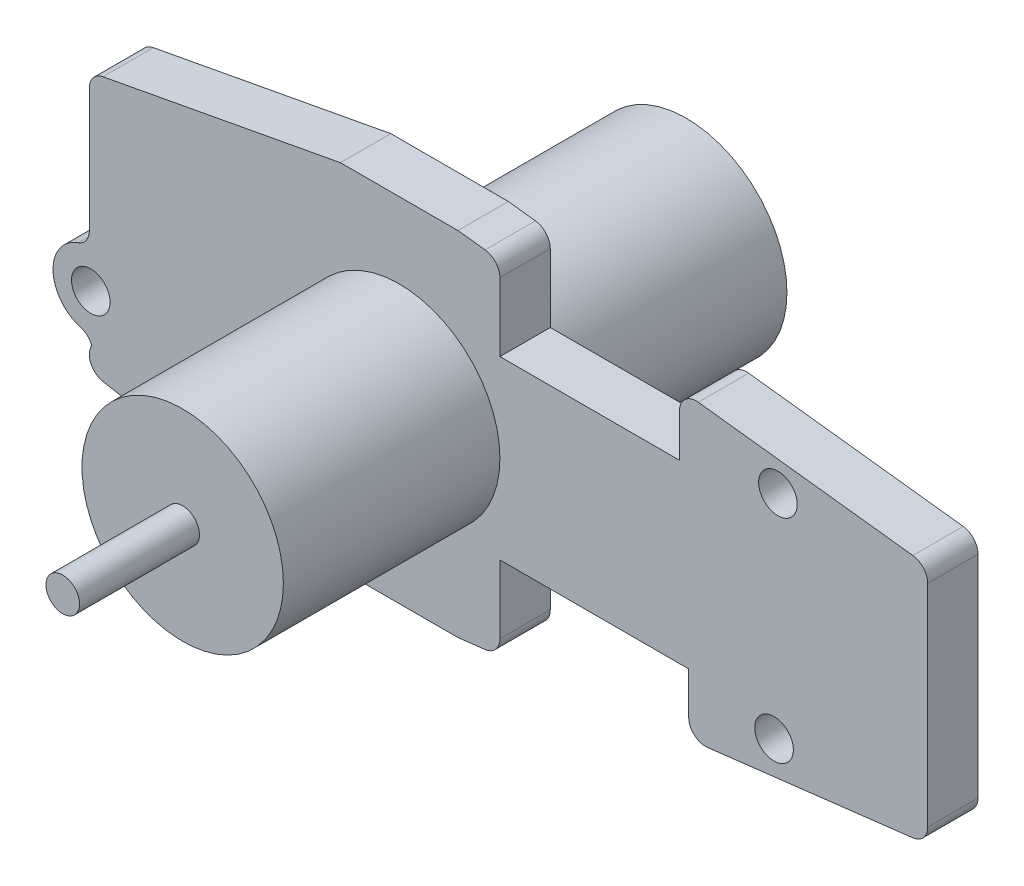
ISO-10303-21;
HEADER;
FILE_DESCRIPTION(('STEP AP214'),'2;1');
FILE_NAME('part.step','',(''),(''),'','','');
FILE_SCHEMA(('AUTOMOTIVE_DESIGN { 1 0 10303 214 1 1 1 1 }'));
ENDSEC;
DATA;
#1=APPLICATION_CONTEXT('core data for automotive mechanical design processes');
#2=APPLICATION_PROTOCOL_DEFINITION('international standard','automotive_design',2000,#1);
#3=PRODUCT_CONTEXT('',#1,'mechanical');
#4=PRODUCT('Part','Part','',(#3));
#5=PRODUCT_RELATED_PRODUCT_CATEGORY('part','',(#4));
#6=PRODUCT_DEFINITION_FORMATION('','',#4);
#7=PRODUCT_DEFINITION_CONTEXT('part definition',#1,'design');
#8=PRODUCT_DEFINITION('design','',#6,#7);
#9=PRODUCT_DEFINITION_SHAPE('','',#8);
#10=(LENGTH_UNIT() NAMED_UNIT(*) SI_UNIT(.MILLI.,.METRE.));
#11=(NAMED_UNIT(*) PLANE_ANGLE_UNIT() SI_UNIT($,.RADIAN.));
#12=(NAMED_UNIT(*) SI_UNIT($,.STERADIAN.) SOLID_ANGLE_UNIT());
#13=UNCERTAINTY_MEASURE_WITH_UNIT(LENGTH_MEASURE(1.E-05),#10,'distance_accuracy_value','');
#14=(GEOMETRIC_REPRESENTATION_CONTEXT(3) GLOBAL_UNCERTAINTY_ASSIGNED_CONTEXT((#13)) GLOBAL_UNIT_ASSIGNED_CONTEXT((#10,
#11,#12)) REPRESENTATION_CONTEXT('',''));
#15=CARTESIAN_POINT('',(0.,0.,0.));
#16=DIRECTION('',(0.,0.,1.));
#17=DIRECTION('',(1.,0.,0.));
#18=AXIS2_PLACEMENT_3D('',#15,#16,#17);
#19=CARTESIAN_POINT('',(0.,0.,37.1439675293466));
#20=DIRECTION('',(0.,0.,-1.));
#21=DIRECTION('',(-1.,0.,0.));
#22=AXIS2_PLACEMENT_3D('',#19,#20,#21);
#23=PLANE('',#22);
#24=CARTESIAN_POINT('',(0.,0.,37.1439675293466));
#25=DIRECTION('',(0.,0.,1.));
#26=DIRECTION('',(1.,0.,0.));
#27=AXIS2_PLACEMENT_3D('',#24,#25,#26);
#28=CIRCLE('',#27,1.);
#29=CARTESIAN_POINT('',(1.,0.,37.1439675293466));
#30=VERTEX_POINT('',#29);
#31=EDGE_CURVE('E20',#30,#30,#28,.F.);
#32=ORIENTED_EDGE('',*,*,#31,.F.);
#33=EDGE_LOOP('',(#32));
#34=FACE_BOUND('',#33,.T.);
#35=ADVANCED_FACE('F17',(#34),#23,.F.);
#36=CARTESIAN_POINT('',(0.,0.,36.));
#37=DIRECTION('',(0.,0.,1.));
#38=DIRECTION('',(1.,0.,0.));
#39=AXIS2_PLACEMENT_3D('',#36,#37,#38);
#40=CYLINDRICAL_SURFACE('',#39,1.);
#41=CARTESIAN_POINT('',(0.,0.,30.));
#42=DIRECTION('',(0.,0.,1.));
#43=DIRECTION('',(1.,0.,0.));
#44=AXIS2_PLACEMENT_3D('',#41,#42,#43);
#45=CIRCLE('',#44,1.);
#46=CARTESIAN_POINT('',(1.,0.,30.));
#47=VERTEX_POINT('',#46);
#48=EDGE_CURVE('E505',#47,#47,#45,.T.);
#49=ORIENTED_EDGE('',*,*,#48,.T.);
#50=EDGE_LOOP('',(#49));
#51=FACE_BOUND('',#50,.T.);
#52=ORIENTED_EDGE('',*,*,#31,.T.);
#53=EDGE_LOOP('',(#52));
#54=FACE_BOUND('',#53,.T.);
#55=ADVANCED_FACE('F512',(#51,#54),#40,.T.);
#56=CARTESIAN_POINT('',(0.,0.,-0.5));
#57=DIRECTION('',(0.,0.,-1.));
#58=DIRECTION('',(-1.,0.,0.));
#59=AXIS2_PLACEMENT_3D('',#56,#57,#58);
#60=PLANE('',#59);
#61=CARTESIAN_POINT('',(0.,0.,-0.5));
#62=DIRECTION('',(0.,0.,-1.));
#63=DIRECTION('',(-1.,0.,0.));
#64=AXIS2_PLACEMENT_3D('',#61,#62,#63);
#65=CIRCLE('',#64,1.);
#66=CARTESIAN_POINT('',(-1.,0.,-0.5));
#67=VERTEX_POINT('',#66);
#68=EDGE_CURVE('E502',#67,#67,#65,.F.);
#69=ORIENTED_EDGE('',*,*,#68,.F.);
#70=EDGE_LOOP('',(#69));
#71=FACE_BOUND('',#70,.T.);
#72=ADVANCED_FACE('F519',(#71),#60,.T.);
#73=CARTESIAN_POINT('',(0.,0.,30.));
#74=DIRECTION('',(0.,0.,-1.));
#75=DIRECTION('',(-1.,0.,0.));
#76=AXIS2_PLACEMENT_3D('',#73,#74,#75);
#77=PLANE('',#76);
#78=CARTESIAN_POINT('',(0.,0.,30.));
#79=DIRECTION('',(0.,0.,1.));
#80=DIRECTION('',(1.,0.,0.));
#81=AXIS2_PLACEMENT_3D('',#78,#79,#80);
#82=CIRCLE('',#81,6.);
#83=CARTESIAN_POINT('',(6.,0.,30.));
#84=VERTEX_POINT('',#83);
#85=EDGE_CURVE('E499',#84,#84,#82,.F.);
#86=ORIENTED_EDGE('',*,*,#85,.F.);
#87=EDGE_LOOP('',(#86));
#88=FACE_BOUND('',#87,.T.);
#89=ORIENTED_EDGE('',*,*,#48,.F.);
#90=EDGE_LOOP('',(#89));
#91=FACE_BOUND('',#90,.T.);
#92=ADVANCED_FACE('F660',(#88,#91),#77,.F.);
#93=CARTESIAN_POINT('',(0.,0.,-0.5));
#94=DIRECTION('',(0.,0.,-1.));
#95=DIRECTION('',(-1.,0.,0.));
#96=AXIS2_PLACEMENT_3D('',#93,#94,#95);
#97=CYLINDRICAL_SURFACE('',#96,1.);
#98=CARTESIAN_POINT('',(0.,0.,0.));
#99=DIRECTION('',(0.,0.,-1.));
#100=DIRECTION('',(-1.,0.,0.));
#101=AXIS2_PLACEMENT_3D('',#98,#99,#100);
#102=CIRCLE('',#101,1.);
#103=CARTESIAN_POINT('',(-1.,0.,0.));
#104=VERTEX_POINT('',#103);
#105=EDGE_CURVE('E495',#104,#104,#102,.F.);
#106=ORIENTED_EDGE('',*,*,#105,.F.);
#107=EDGE_LOOP('',(#106));
#108=FACE_BOUND('',#107,.T.);
#109=ORIENTED_EDGE('',*,*,#68,.T.);
#110=EDGE_LOOP('',(#109));
#111=FACE_BOUND('',#110,.T.);
#112=ADVANCED_FACE('F656',(#108,#111),#97,.T.);
#113=CARTESIAN_POINT('',(0.,0.,30.));
#114=DIRECTION('',(0.,0.,1.));
#115=DIRECTION('',(1.,0.,0.));
#116=AXIS2_PLACEMENT_3D('',#113,#114,#115);
#117=CYLINDRICAL_SURFACE('',#116,6.);
#118=ORIENTED_EDGE('',*,*,#85,.T.);
#119=EDGE_LOOP('',(#118));
#120=FACE_BOUND('',#119,.T.);
#121=CARTESIAN_POINT('',(0.,0.,17.1));
#122=DIRECTION('',(0.,0.,1.));
#123=DIRECTION('',(1.,0.,0.));
#124=AXIS2_PLACEMENT_3D('',#121,#122,#123);
#125=CIRCLE('',#124,6.);
#126=CARTESIAN_POINT('',(6.,0.,17.1));
#127=VERTEX_POINT('',#126);
#128=EDGE_CURVE('E465',#127,#127,#125,.F.);
#129=ORIENTED_EDGE('',*,*,#128,.F.);
#130=EDGE_LOOP('',(#129));
#131=FACE_BOUND('',#130,.T.);
#132=ADVANCED_FACE('F652',(#120,#131),#117,.T.);
#133=CARTESIAN_POINT('',(0.,0.,0.));
#134=DIRECTION('',(0.,0.,-1.));
#135=DIRECTION('',(-1.,0.,0.));
#136=AXIS2_PLACEMENT_3D('',#133,#134,#135);
#137=PLANE('',#136);
#138=ORIENTED_EDGE('',*,*,#105,.T.);
#139=EDGE_LOOP('',(#138));
#140=FACE_BOUND('',#139,.T.);
#141=CARTESIAN_POINT('',(0.,0.,0.));
#142=DIRECTION('',(0.,0.,1.));
#143=DIRECTION('',(1.,0.,0.));
#144=AXIS2_PLACEMENT_3D('',#141,#142,#143);
#145=CIRCLE('',#144,6.);
#146=CARTESIAN_POINT('',(6.,0.,0.));
#147=VERTEX_POINT('',#146);
#148=EDGE_CURVE('E365',#147,#147,#145,.T.);
#149=ORIENTED_EDGE('',*,*,#148,.F.);
#150=EDGE_LOOP('',(#149));
#151=FACE_BOUND('',#150,.T.);
#152=ADVANCED_FACE('F648',(#140,#151),#137,.T.);
#153=CARTESIAN_POINT('',(18.2459173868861,-7.7434707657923,17.1));
#154=DIRECTION('',(0.,0.,1.));
#155=DIRECTION('',(1.,0.,0.));
#156=AXIS2_PLACEMENT_3D('',#153,#154,#155);
#157=CYLINDRICAL_SURFACE('',#156,1.);
#158=CARTESIAN_POINT('',(18.2459173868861,-7.7434707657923,14.1));
#159=DIRECTION('',(0.,0.,1.));
#160=DIRECTION('',(1.,0.,0.));
#161=AXIS2_PLACEMENT_3D('',#158,#159,#160);
#162=CIRCLE('',#161,1.);
#163=CARTESIAN_POINT('',(17.2459173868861,-7.7434707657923,14.1));
#164=VERTEX_POINT('',#163);
#165=CARTESIAN_POINT('',(18.3637351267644,-8.73650600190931,14.1));
#166=VERTEX_POINT('',#165);
#167=EDGE_CURVE('E102',#164,#166,#162,.T.);
#168=ORIENTED_EDGE('',*,*,#167,.T.);
#169=DIRECTION('',(0.,0.,1.));
#170=VECTOR('',#169,1.);
#171=CARTESIAN_POINT('',(18.3637351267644,-8.73650600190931,17.1));
#172=LINE('',#171,#170);
#173=CARTESIAN_POINT('',(18.3637351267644,-8.73650600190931,17.1));
#174=VERTEX_POINT('',#173);
#175=EDGE_CURVE('E337',#166,#174,#172,.T.);
#176=ORIENTED_EDGE('',*,*,#175,.T.);
#177=CARTESIAN_POINT('',(18.2459173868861,-7.7434707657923,17.1));
#178=DIRECTION('',(0.,0.,1.));
#179=DIRECTION('',(1.,0.,0.));
#180=AXIS2_PLACEMENT_3D('',#177,#178,#179);
#181=CIRCLE('',#180,1.);
#182=CARTESIAN_POINT('',(17.2459173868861,-7.7434707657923,17.1));
#183=VERTEX_POINT('',#182);
#184=EDGE_CURVE('E207',#183,#174,#181,.T.);
#185=ORIENTED_EDGE('',*,*,#184,.F.);
#186=DIRECTION('',(0.,0.,-1.));
#187=VECTOR('',#186,1.);
#188=CARTESIAN_POINT('',(17.2459173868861,-7.7434707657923,17.1));
#189=LINE('',#188,#187);
#190=EDGE_CURVE('E341',#183,#164,#189,.T.);
#191=ORIENTED_EDGE('',*,*,#190,.T.);
#192=EDGE_LOOP('',(#168,#176,#185,#191));
#193=FACE_BOUND('',#192,.T.);
#194=ADVANCED_FACE('F644',(#193),#157,.T.);
#195=CARTESIAN_POINT('',(30.4822865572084,-6.29169815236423,17.1));
#196=DIRECTION('',(0.,0.,1.));
#197=DIRECTION('',(1.,0.,0.));
#198=AXIS2_PLACEMENT_3D('',#195,#196,#197);
#199=CYLINDRICAL_SURFACE('',#198,1.);
#200=CARTESIAN_POINT('',(30.4822865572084,-6.29169815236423,14.1));
#201=DIRECTION('',(0.,0.,1.));
#202=DIRECTION('',(1.,0.,0.));
#203=AXIS2_PLACEMENT_3D('',#200,#201,#202);
#204=CIRCLE('',#203,1.);
#205=CARTESIAN_POINT('',(30.6001042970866,-7.28473338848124,14.1));
#206=VERTEX_POINT('',#205);
#207=CARTESIAN_POINT('',(31.4822865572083,-6.29169597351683,14.1));
#208=VERTEX_POINT('',#207);
#209=EDGE_CURVE('E492',#206,#208,#204,.T.);
#210=ORIENTED_EDGE('',*,*,#209,.T.);
#211=DIRECTION('',(0.,0.,1.));
#212=VECTOR('',#211,1.);
#213=CARTESIAN_POINT('',(31.4822865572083,-6.29169379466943,17.1));
#214=LINE('',#213,#212);
#215=CARTESIAN_POINT('',(31.4822865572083,-6.29169597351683,17.1));
#216=VERTEX_POINT('',#215);
#217=EDGE_CURVE('E330',#208,#216,#214,.T.);
#218=ORIENTED_EDGE('',*,*,#217,.T.);
#219=CARTESIAN_POINT('',(30.4822865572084,-6.29169815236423,17.1));
#220=DIRECTION('',(0.,0.,1.));
#221=DIRECTION('',(1.,0.,0.));
#222=AXIS2_PLACEMENT_3D('',#219,#220,#221);
#223=CIRCLE('',#222,1.);
#224=CARTESIAN_POINT('',(30.6001042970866,-7.28473338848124,17.1));
#225=VERTEX_POINT('',#224);
#226=EDGE_CURVE('E478',#225,#216,#223,.T.);
#227=ORIENTED_EDGE('',*,*,#226,.F.);
#228=DIRECTION('',(0.,0.,1.));
#229=VECTOR('',#228,1.);
#230=CARTESIAN_POINT('',(30.6001042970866,-7.28473338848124,17.1));
#231=LINE('',#230,#229);
#232=EDGE_CURVE('E336',#225,#206,#231,.F.);
#233=ORIENTED_EDGE('',*,*,#232,.T.);
#234=EDGE_LOOP('',(#210,#218,#227,#233));
#235=FACE_BOUND('',#234,.T.);
#236=ADVANCED_FACE('F640',(#235),#199,.T.);
#237=CARTESIAN_POINT('',(30.4822865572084,6.29169815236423,17.1));
#238=DIRECTION('',(0.,0.,1.));
#239=DIRECTION('',(1.,0.,0.));
#240=AXIS2_PLACEMENT_3D('',#237,#238,#239);
#241=CYLINDRICAL_SURFACE('',#240,1.);
#242=CARTESIAN_POINT('',(30.4822865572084,6.29169815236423,14.1));
#243=DIRECTION('',(0.,0.,1.));
#244=DIRECTION('',(1.,0.,0.));
#245=AXIS2_PLACEMENT_3D('',#242,#243,#244);
#246=CIRCLE('',#245,1.);
#247=CARTESIAN_POINT('',(31.4822865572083,6.29169597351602,14.1));
#248=VERTEX_POINT('',#247);
#249=CARTESIAN_POINT('',(30.6001042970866,7.28473338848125,14.1));
#250=VERTEX_POINT('',#249);
#251=EDGE_CURVE('E490',#248,#250,#246,.T.);
#252=ORIENTED_EDGE('',*,*,#251,.T.);
#253=DIRECTION('',(0.,0.,1.));
#254=VECTOR('',#253,1.);
#255=CARTESIAN_POINT('',(30.6001042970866,7.28473338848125,17.1));
#256=LINE('',#255,#254);
#257=CARTESIAN_POINT('',(30.6001042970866,7.28473338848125,17.1));
#258=VERTEX_POINT('',#257);
#259=EDGE_CURVE('E323',#250,#258,#256,.T.);
#260=ORIENTED_EDGE('',*,*,#259,.T.);
#261=CARTESIAN_POINT('',(30.4822865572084,6.29169815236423,17.1));
#262=DIRECTION('',(0.,0.,1.));
#263=DIRECTION('',(1.,0.,0.));
#264=AXIS2_PLACEMENT_3D('',#261,#262,#263);
#265=CIRCLE('',#264,1.);
#266=CARTESIAN_POINT('',(31.4822865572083,6.29169597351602,17.1));
#267=VERTEX_POINT('',#266);
#268=EDGE_CURVE('E476',#267,#258,#265,.T.);
#269=ORIENTED_EDGE('',*,*,#268,.F.);
#270=DIRECTION('',(0.,0.,1.));
#271=VECTOR('',#270,1.);
#272=CARTESIAN_POINT('',(31.4822865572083,6.2916937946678,17.1));
#273=LINE('',#272,#271);
#274=EDGE_CURVE('E333',#267,#248,#273,.F.);
#275=ORIENTED_EDGE('',*,*,#274,.T.);
#276=EDGE_LOOP('',(#252,#260,#269,#275));
#277=FACE_BOUND('',#276,.T.);
#278=ADVANCED_FACE('F636',(#277),#241,.T.);
#279=CARTESIAN_POINT('',(17.7,7.80824062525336,17.1));
#280=DIRECTION('',(0.,0.,1.));
#281=DIRECTION('',(1.,0.,0.));
#282=AXIS2_PLACEMENT_3D('',#279,#280,#281);
#283=CYLINDRICAL_SURFACE('',#282,1.);
#284=CARTESIAN_POINT('',(17.7,7.80824062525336,14.1));
#285=DIRECTION('',(0.,0.,1.));
#286=DIRECTION('',(1.,0.,0.));
#287=AXIS2_PLACEMENT_3D('',#284,#285,#286);
#288=CIRCLE('',#287,1.);
#289=CARTESIAN_POINT('',(17.8178177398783,8.80127586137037,14.1));
#290=VERTEX_POINT('',#289);
#291=CARTESIAN_POINT('',(16.7,7.80824062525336,14.1));
#292=VERTEX_POINT('',#291);
#293=EDGE_CURVE('E488',#290,#292,#288,.T.);
#294=ORIENTED_EDGE('',*,*,#293,.T.);
#295=DIRECTION('',(0.,0.,-1.));
#296=VECTOR('',#295,1.);
#297=CARTESIAN_POINT('',(16.7,7.80824062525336,17.1));
#298=LINE('',#297,#296);
#299=CARTESIAN_POINT('',(16.7,7.80824062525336,17.1));
#300=VERTEX_POINT('',#299);
#301=EDGE_CURVE('E319',#292,#300,#298,.F.);
#302=ORIENTED_EDGE('',*,*,#301,.T.);
#303=CARTESIAN_POINT('',(17.7,7.80824062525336,17.1));
#304=DIRECTION('',(0.,0.,1.));
#305=DIRECTION('',(1.,0.,0.));
#306=AXIS2_PLACEMENT_3D('',#303,#304,#305);
#307=CIRCLE('',#306,1.);
#308=CARTESIAN_POINT('',(17.8178177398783,8.80127586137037,17.1));
#309=VERTEX_POINT('',#308);
#310=EDGE_CURVE('E474',#309,#300,#307,.T.);
#311=ORIENTED_EDGE('',*,*,#310,.F.);
#312=DIRECTION('',(0.,0.,1.));
#313=VECTOR('',#312,1.);
#314=CARTESIAN_POINT('',(17.8178177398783,8.80127586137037,17.1));
#315=LINE('',#314,#313);
#316=EDGE_CURVE('E322',#309,#290,#315,.F.);
#317=ORIENTED_EDGE('',*,*,#316,.T.);
#318=EDGE_LOOP('',(#294,#302,#311,#317));
#319=FACE_BOUND('',#318,.T.);
#320=ADVANCED_FACE('F632',(#319),#283,.T.);
#321=CARTESIAN_POINT('',(5.,9.31502028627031,17.1));
#322=DIRECTION('',(0.,0.,1.));
#323=DIRECTION('',(1.,0.,0.));
#324=AXIS2_PLACEMENT_3D('',#321,#322,#323);
#325=CYLINDRICAL_SURFACE('',#324,1.);
#326=CARTESIAN_POINT('',(5.,9.31502028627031,14.1));
#327=DIRECTION('',(0.,0.,1.));
#328=DIRECTION('',(1.,0.,0.));
#329=AXIS2_PLACEMENT_3D('',#326,#327,#328);
#330=CIRCLE('',#329,1.);
#331=CARTESIAN_POINT('',(6.,9.31502028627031,14.1));
#332=VERTEX_POINT('',#331);
#333=CARTESIAN_POINT('',(5.11781773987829,10.3080555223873,14.1));
#334=VERTEX_POINT('',#333);
#335=EDGE_CURVE('E391',#332,#334,#330,.T.);
#336=ORIENTED_EDGE('',*,*,#335,.T.);
#337=DIRECTION('',(0.,0.,1.));
#338=VECTOR('',#337,1.);
#339=CARTESIAN_POINT('',(5.11781773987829,10.3080555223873,17.1));
#340=LINE('',#339,#338);
#341=CARTESIAN_POINT('',(5.1178177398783,10.3080555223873,17.1));
#342=VERTEX_POINT('',#341);
#343=EDGE_CURVE('E390',#334,#342,#340,.T.);
#344=ORIENTED_EDGE('',*,*,#343,.T.);
#345=CARTESIAN_POINT('',(5.,9.31502028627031,17.1));
#346=DIRECTION('',(0.,0.,1.));
#347=DIRECTION('',(1.,0.,0.));
#348=AXIS2_PLACEMENT_3D('',#345,#346,#347);
#349=CIRCLE('',#348,1.);
#350=CARTESIAN_POINT('',(6.,9.31502028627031,17.1));
#351=VERTEX_POINT('',#350);
#352=EDGE_CURVE('E356',#351,#342,#349,.T.);
#353=ORIENTED_EDGE('',*,*,#352,.F.);
#354=DIRECTION('',(0.,0.,1.));
#355=VECTOR('',#354,1.);
#356=CARTESIAN_POINT('',(6.,9.31502028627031,17.1));
#357=LINE('',#356,#355);
#358=EDGE_CURVE('E292',#351,#332,#357,.F.);
#359=ORIENTED_EDGE('',*,*,#358,.T.);
#360=EDGE_LOOP('',(#336,#344,#353,#359));
#361=FACE_BOUND('',#360,.T.);
#362=ADVANCED_FACE('F628',(#361),#325,.T.);
#363=CARTESIAN_POINT('',(3.5,10.5,17.1));
#364=DIRECTION('',(-0.11781773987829,-0.993035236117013,0.));
#365=DIRECTION('',(0.993035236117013,-0.11781773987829,0.));
#366=AXIS2_PLACEMENT_3D('',#363,#364,#365);
#367=PLANE('',#366);
#368=ORIENTED_EDGE('',*,*,#343,.F.);
#369=DIRECTION('',(0.993035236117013,-0.11781773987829,0.));
#370=VECTOR('',#369,1.);
#371=CARTESIAN_POINT('',(3.5,10.5,14.1));
#372=LINE('',#371,#370);
#373=CARTESIAN_POINT('',(3.5,10.5,14.1));
#374=VERTEX_POINT('',#373);
#375=EDGE_CURVE('E386',#374,#334,#372,.T.);
#376=ORIENTED_EDGE('',*,*,#375,.F.);
#377=DIRECTION('',(0.,0.,-1.));
#378=VECTOR('',#377,1.);
#379=CARTESIAN_POINT('',(3.5,10.5,17.1));
#380=LINE('',#379,#378);
#381=CARTESIAN_POINT('',(3.5,10.5,17.1));
#382=VERTEX_POINT('',#381);
#383=EDGE_CURVE('E288',#374,#382,#380,.F.);
#384=ORIENTED_EDGE('',*,*,#383,.T.);
#385=DIRECTION('',(-0.993035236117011,0.117817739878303,0.));
#386=VECTOR('',#385,1.);
#387=CARTESIAN_POINT('',(5.11781773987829,10.3080555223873,17.1));
#388=LINE('',#387,#386);
#389=EDGE_CURVE('E352',#342,#382,#388,.T.);
#390=ORIENTED_EDGE('',*,*,#389,.F.);
#391=EDGE_LOOP('',(#368,#376,#384,#390));
#392=FACE_BOUND('',#391,.T.);
#393=ADVANCED_FACE('F624',(#392),#367,.F.);
#394=CARTESIAN_POINT('',(-17.4597915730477,6.88009539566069,17.1));
#395=DIRECTION('',(0.,0.,1.));
#396=DIRECTION('',(1.,0.,0.));
#397=AXIS2_PLACEMENT_3D('',#394,#395,#396);
#398=CYLINDRICAL_SURFACE('',#397,1.);
#399=CARTESIAN_POINT('',(-17.4597915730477,6.88009539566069,14.1));
#400=DIRECTION('',(0.,0.,1.));
#401=DIRECTION('',(1.,0.,0.));
#402=AXIS2_PLACEMENT_3D('',#399,#400,#401);
#403=CIRCLE('',#402,1.);
#404=CARTESIAN_POINT('',(-17.6430740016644,7.86315569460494,14.1));
#405=VERTEX_POINT('',#404);
#406=CARTESIAN_POINT('',(-18.4597915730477,6.88009539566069,14.1));
#407=VERTEX_POINT('',#406);
#408=EDGE_CURVE('E419',#405,#407,#403,.T.);
#409=ORIENTED_EDGE('',*,*,#408,.T.);
#410=DIRECTION('',(0.,0.,-1.));
#411=VECTOR('',#410,1.);
#412=CARTESIAN_POINT('',(-18.4597915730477,6.88009539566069,17.1));
#413=LINE('',#412,#411);
#414=CARTESIAN_POINT('',(-18.4597915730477,6.88009539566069,17.1));
#415=VERTEX_POINT('',#414);
#416=EDGE_CURVE('E262',#407,#415,#413,.F.);
#417=ORIENTED_EDGE('',*,*,#416,.T.);
#418=CARTESIAN_POINT('',(-17.4597915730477,6.88009539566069,17.1));
#419=DIRECTION('',(0.,0.,1.));
#420=DIRECTION('',(1.,0.,0.));
#421=AXIS2_PLACEMENT_3D('',#418,#419,#420);
#422=CIRCLE('',#421,1.);
#423=CARTESIAN_POINT('',(-17.6430740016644,7.86315569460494,17.1));
#424=VERTEX_POINT('',#423);
#425=EDGE_CURVE('E355',#424,#415,#422,.T.);
#426=ORIENTED_EDGE('',*,*,#425,.F.);
#427=DIRECTION('',(0.,0.,1.));
#428=VECTOR('',#427,1.);
#429=CARTESIAN_POINT('',(-17.6430740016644,7.86315569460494,17.1));
#430=LINE('',#429,#428);
#431=EDGE_CURVE('E266',#424,#405,#430,.F.);
#432=ORIENTED_EDGE('',*,*,#431,.T.);
#433=EDGE_LOOP('',(#409,#417,#426,#432));
#434=FACE_BOUND('',#433,.T.);
#435=ADVANCED_FACE('F620',(#434),#398,.T.);
#436=CARTESIAN_POINT('',(-19.4597915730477,-0.500001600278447,17.1));
#437=DIRECTION('',(0.,0.,1.));
#438=DIRECTION('',(1.,0.,0.));
#439=AXIS2_PLACEMENT_3D('',#436,#437,#438);
#440=CYLINDRICAL_SURFACE('',#439,1.);
#441=DIRECTION('',(0.,0.,-1.));
#442=VECTOR('',#441,1.);
#443=CARTESIAN_POINT('',(-19.1258806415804,-1.44260623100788,17.1));
#444=LINE('',#443,#442);
#445=CARTESIAN_POINT('',(-19.1258826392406,-1.44260693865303,17.1));
#446=VERTEX_POINT('',#445);
#447=CARTESIAN_POINT('',(-19.1258826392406,-1.44260693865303,14.1));
#448=VERTEX_POINT('',#447);
#449=EDGE_CURVE('E255',#446,#448,#444,.T.);
#450=ORIENTED_EDGE('',*,*,#449,.F.);
#451=CARTESIAN_POINT('',(-19.4597915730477,-0.500001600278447,17.1));
#452=DIRECTION('',(0.,0.,1.));
#453=DIRECTION('',(1.,0.,0.));
#454=AXIS2_PLACEMENT_3D('',#451,#452,#453);
#455=CIRCLE('',#454,1.);
#456=CARTESIAN_POINT('',(-18.4597915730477,-0.500001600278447,17.1));
#457=VERTEX_POINT('',#456);
#458=EDGE_CURVE('E470',#457,#446,#455,.F.);
#459=ORIENTED_EDGE('',*,*,#458,.F.);
#460=DIRECTION('',(0.,0.,-1.));
#461=VECTOR('',#460,1.);
#462=CARTESIAN_POINT('',(-18.4597915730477,-0.500001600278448,17.1));
#463=LINE('',#462,#461);
#464=CARTESIAN_POINT('',(-18.4597915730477,-0.500001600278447,14.1));
#465=VERTEX_POINT('',#464);
#466=EDGE_CURVE('E267',#457,#465,#463,.T.);
#467=ORIENTED_EDGE('',*,*,#466,.T.);
#468=CARTESIAN_POINT('',(-19.4597915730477,-0.500001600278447,14.1));
#469=DIRECTION('',(0.,0.,1.));
#470=DIRECTION('',(1.,0.,0.));
#471=AXIS2_PLACEMENT_3D('',#468,#469,#470);
#472=CIRCLE('',#471,1.);
#473=EDGE_CURVE('E483',#448,#465,#472,.T.);
#474=ORIENTED_EDGE('',*,*,#473,.F.);
#475=EDGE_LOOP('',(#450,#459,#467,#474));
#476=FACE_BOUND('',#475,.T.);
#477=ADVANCED_FACE('F616',(#476),#440,.F.);
#478=CARTESIAN_POINT('',(-19.2592509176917,-6.69075156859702,17.1));
#479=DIRECTION('',(0.,0.,1.));
#480=DIRECTION('',(1.,0.,0.));
#481=AXIS2_PLACEMENT_3D('',#478,#479,#480);
#482=CYLINDRICAL_SURFACE('',#481,1.);
#483=DIRECTION('',(0.,0.,1.));
#484=VECTOR('',#483,1.);
#485=CARTESIAN_POINT('',(-18.315333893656,-6.36056881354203,17.1));
#486=LINE('',#485,#484);
#487=CARTESIAN_POINT('',(-18.315333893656,-6.36056881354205,17.1));
#488=VERTEX_POINT('',#487);
#489=CARTESIAN_POINT('',(-18.315333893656,-6.36056881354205,14.1));
#490=VERTEX_POINT('',#489);
#491=EDGE_CURVE('E240',#488,#490,#486,.F.);
#492=ORIENTED_EDGE('',*,*,#491,.F.);
#493=CARTESIAN_POINT('',(-19.2592509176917,-6.69075156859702,17.1));
#494=DIRECTION('',(0.,0.,1.));
#495=DIRECTION('',(1.,0.,0.));
#496=AXIS2_PLACEMENT_3D('',#493,#494,#495);
#497=CIRCLE('',#496,1.);
#498=CARTESIAN_POINT('',(-18.9870467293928,-5.72851205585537,17.1));
#499=VERTEX_POINT('',#498);
#500=EDGE_CURVE('E468',#499,#488,#497,.F.);
#501=ORIENTED_EDGE('',*,*,#500,.F.);
#502=DIRECTION('',(0.,0.,-1.));
#503=VECTOR('',#502,1.);
#504=CARTESIAN_POINT('',(-18.9870446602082,-5.72851264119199,17.1));
#505=LINE('',#504,#503);
#506=CARTESIAN_POINT('',(-18.9870467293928,-5.72851205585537,14.1));
#507=VERTEX_POINT('',#506);
#508=EDGE_CURVE('E258',#507,#499,#505,.F.);
#509=ORIENTED_EDGE('',*,*,#508,.F.);
#510=CARTESIAN_POINT('',(-19.2592509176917,-6.69075156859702,14.1));
#511=DIRECTION('',(0.,0.,1.));
#512=DIRECTION('',(1.,0.,0.));
#513=AXIS2_PLACEMENT_3D('',#510,#511,#512);
#514=CIRCLE('',#513,1.);
#515=EDGE_CURVE('E428',#490,#507,#514,.T.);
#516=ORIENTED_EDGE('',*,*,#515,.F.);
#517=EDGE_LOOP('',(#492,#501,#509,#516));
#518=FACE_BOUND('',#517,.T.);
#519=ADVANCED_FACE('F612',(#518),#482,.F.);
#520=CARTESIAN_POINT('',(3.5,-10.5,17.1));
#521=DIRECTION('',(-0.117817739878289,0.993035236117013,0.));
#522=DIRECTION('',(-0.993035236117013,-0.117817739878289,0.));
#523=AXIS2_PLACEMENT_3D('',#520,#521,#522);
#524=PLANE('',#523);
#525=DIRECTION('',(0.,0.,1.));
#526=VECTOR('',#525,1.);
#527=CARTESIAN_POINT('',(5.11781773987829,-10.3080555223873,17.1));
#528=LINE('',#527,#526);
#529=CARTESIAN_POINT('',(5.1178177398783,-10.3080555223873,17.1));
#530=VERTEX_POINT('',#529);
#531=CARTESIAN_POINT('',(5.11781773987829,-10.3080555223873,14.1));
#532=VERTEX_POINT('',#531);
#533=EDGE_CURVE('E420',#530,#532,#528,.F.);
#534=ORIENTED_EDGE('',*,*,#533,.F.);
#535=DIRECTION('',(0.993035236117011,0.117817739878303,0.));
#536=VECTOR('',#535,1.);
#537=CARTESIAN_POINT('',(3.5,-10.5,17.1));
#538=LINE('',#537,#536);
#539=CARTESIAN_POINT('',(3.5,-10.5,17.1));
#540=VERTEX_POINT('',#539);
#541=EDGE_CURVE('E205',#540,#530,#538,.T.);
#542=ORIENTED_EDGE('',*,*,#541,.F.);
#543=DIRECTION('',(0.,0.,1.));
#544=VECTOR('',#543,1.);
#545=CARTESIAN_POINT('',(3.5,-10.5,17.1));
#546=LINE('',#545,#544);
#547=CARTESIAN_POINT('',(3.5,-10.5,14.1));
#548=VERTEX_POINT('',#547);
#549=EDGE_CURVE('E220',#540,#548,#546,.F.);
#550=ORIENTED_EDGE('',*,*,#549,.T.);
#551=DIRECTION('',(-0.993035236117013,-0.117817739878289,0.));
#552=VECTOR('',#551,1.);
#553=CARTESIAN_POINT('',(3.5,-10.5,14.1));
#554=LINE('',#553,#552);
#555=EDGE_CURVE('E422',#532,#548,#554,.T.);
#556=ORIENTED_EDGE('',*,*,#555,.F.);
#557=EDGE_LOOP('',(#534,#542,#550,#556));
#558=FACE_BOUND('',#557,.T.);
#559=ADVANCED_FACE('F609',(#558),#524,.F.);
#560=CARTESIAN_POINT('',(5.,-9.31502028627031,17.1));
#561=DIRECTION('',(0.,0.,1.));
#562=DIRECTION('',(1.,0.,0.));
#563=AXIS2_PLACEMENT_3D('',#560,#561,#562);
#564=CYLINDRICAL_SURFACE('',#563,1.);
#565=CARTESIAN_POINT('',(5.,-9.31502028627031,14.1));
#566=DIRECTION('',(0.,0.,1.));
#567=DIRECTION('',(1.,0.,0.));
#568=AXIS2_PLACEMENT_3D('',#565,#566,#567);
#569=CIRCLE('',#568,1.);
#570=CARTESIAN_POINT('',(6.,-9.31502028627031,14.1));
#571=VERTEX_POINT('',#570);
#572=EDGE_CURVE('E35',#532,#571,#569,.T.);
#573=ORIENTED_EDGE('',*,*,#572,.T.);
#574=DIRECTION('',(0.,0.,1.));
#575=VECTOR('',#574,1.);
#576=CARTESIAN_POINT('',(6.,-9.31502028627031,17.1));
#577=LINE('',#576,#575);
#578=CARTESIAN_POINT('',(6.,-9.31502028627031,17.1));
#579=VERTEX_POINT('',#578);
#580=EDGE_CURVE('E212',#571,#579,#577,.T.);
#581=ORIENTED_EDGE('',*,*,#580,.T.);
#582=CARTESIAN_POINT('',(5.,-9.31502028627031,17.1));
#583=DIRECTION('',(0.,0.,1.));
#584=DIRECTION('',(1.,0.,0.));
#585=AXIS2_PLACEMENT_3D('',#582,#583,#584);
#586=CIRCLE('',#585,1.);
#587=EDGE_CURVE('E198',#530,#579,#586,.T.);
#588=ORIENTED_EDGE('',*,*,#587,.F.);
#589=ORIENTED_EDGE('',*,*,#533,.T.);
#590=EDGE_LOOP('',(#573,#581,#588,#589));
#591=FACE_BOUND('',#590,.T.);
#592=ADVANCED_FACE('F218',(#591),#564,.T.);
#593=CARTESIAN_POINT('',(0.,0.,17.1));
#594=DIRECTION('',(0.,0.,1.));
#595=DIRECTION('',(1.,0.,0.));
#596=AXIS2_PLACEMENT_3D('',#593,#594,#595);
#597=PLANE('',#596);
#598=ORIENTED_EDGE('',*,*,#128,.T.);
#599=EDGE_LOOP('',(#598));
#600=FACE_BOUND('',#599,.T.);
#601=CARTESIAN_POINT('',(22.5623929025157,6.46549040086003,17.1));
#602=DIRECTION('',(0.,0.,1.));
#603=DIRECTION('',(1.,0.,0.));
#604=AXIS2_PLACEMENT_3D('',#601,#602,#603);
#605=CIRCLE('',#604,1.15);
#606=CARTESIAN_POINT('',(23.7123929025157,6.46549040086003,17.1));
#607=VERTEX_POINT('',#606);
#608=EDGE_CURVE('E456',#607,#607,#605,.F.);
#609=ORIENTED_EDGE('',*,*,#608,.T.);
#610=EDGE_LOOP('',(#609));
#611=FACE_BOUND('',#610,.T.);
#612=CARTESIAN_POINT('',(22.3323926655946,-6.30699156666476,17.1));
#613=DIRECTION('',(0.,0.,1.));
#614=DIRECTION('',(1.,0.,0.));
#615=AXIS2_PLACEMENT_3D('',#612,#613,#614);
#616=CIRCLE('',#615,1.15);
#617=CARTESIAN_POINT('',(23.4823926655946,-6.30699156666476,17.1));
#618=VERTEX_POINT('',#617);
#619=EDGE_CURVE('E459',#618,#618,#616,.F.);
#620=ORIENTED_EDGE('',*,*,#619,.T.);
#621=EDGE_LOOP('',(#620));
#622=FACE_BOUND('',#621,.T.);
#623=DIRECTION('',(-0.983060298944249,0.183282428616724,0.));
#624=VECTOR('',#623,1.);
#625=CARTESIAN_POINT('',(-33.,-5.,17.1));
#626=LINE('',#625,#624);
#627=CARTESIAN_POINT('',(-17.6440512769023,-7.86297349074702,17.1));
#628=VERTEX_POINT('',#627);
#629=CARTESIAN_POINT('',(-3.49999999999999,-10.5,17.1));
#630=VERTEX_POINT('',#629);
#631=EDGE_CURVE('E239',#628,#630,#626,.F.);
#632=ORIENTED_EDGE('',*,*,#631,.T.);
#633=DIRECTION('',(1.,0.,0.));
#634=VECTOR('',#633,1.);
#635=CARTESIAN_POINT('',(-3.5,-10.5,17.1));
#636=LINE('',#635,#634);
#637=EDGE_CURVE('E249',#630,#540,#636,.T.);
#638=ORIENTED_EDGE('',*,*,#637,.T.);
#639=ORIENTED_EDGE('',*,*,#541,.T.);
#640=ORIENTED_EDGE('',*,*,#587,.T.);
#641=DIRECTION('',(0.,-1.,0.));
#642=VECTOR('',#641,1.);
#643=CARTESIAN_POINT('',(6.,-5.24570514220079,17.1));
#644=LINE('',#643,#642);
#645=CARTESIAN_POINT('',(6.,-5.24570514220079,17.1));
#646=VERTEX_POINT('',#645);
#647=EDGE_CURVE('E203',#579,#646,#644,.F.);
#648=ORIENTED_EDGE('',*,*,#647,.T.);
#649=DIRECTION('',(1.,0.,0.));
#650=VECTOR('',#649,1.);
#651=CARTESIAN_POINT('',(6.,-5.24570514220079,17.1));
#652=LINE('',#651,#650);
#653=CARTESIAN_POINT('',(17.2459173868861,-5.24570514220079,17.1));
#654=VERTEX_POINT('',#653);
#655=EDGE_CURVE('E349',#646,#654,#652,.T.);
#656=ORIENTED_EDGE('',*,*,#655,.T.);
#657=DIRECTION('',(0.,1.,0.));
#658=VECTOR('',#657,1.);
#659=CARTESIAN_POINT('',(17.2459173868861,-5.24570514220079,17.1));
#660=LINE('',#659,#658);
#661=EDGE_CURVE('E346',#654,#183,#660,.F.);
#662=ORIENTED_EDGE('',*,*,#661,.T.);
#663=ORIENTED_EDGE('',*,*,#184,.T.);
#664=DIRECTION('',(-0.993035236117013,-0.11781773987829,0.));
#665=VECTOR('',#664,1.);
#666=CARTESIAN_POINT('',(17.2459173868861,-8.86912844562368,17.1));
#667=LINE('',#666,#665);
#668=EDGE_CURVE('E340',#174,#225,#667,.F.);
#669=ORIENTED_EDGE('',*,*,#668,.T.);
#670=ORIENTED_EDGE('',*,*,#226,.T.);
#671=DIRECTION('',(0.,1.,0.));
#672=VECTOR('',#671,1.);
#673=CARTESIAN_POINT('',(31.4822865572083,-7.,17.1));
#674=LINE('',#673,#672);
#675=EDGE_CURVE('E327',#216,#267,#674,.T.);
#676=ORIENTED_EDGE('',*,*,#675,.T.);
#677=ORIENTED_EDGE('',*,*,#268,.T.);
#678=DIRECTION('',(0.993035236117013,-0.11781773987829,0.));
#679=VECTOR('',#678,1.);
#680=CARTESIAN_POINT('',(16.7,8.93389830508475,17.1));
#681=LINE('',#680,#679);
#682=EDGE_CURVE('E326',#258,#309,#681,.F.);
#683=ORIENTED_EDGE('',*,*,#682,.T.);
#684=ORIENTED_EDGE('',*,*,#310,.T.);
#685=DIRECTION('',(0.,1.,0.));
#686=VECTOR('',#685,1.);
#687=CARTESIAN_POINT('',(16.7,5.24570514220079,17.1));
#688=LINE('',#687,#686);
#689=CARTESIAN_POINT('',(16.7,5.24570514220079,17.1));
#690=VERTEX_POINT('',#689);
#691=EDGE_CURVE('E316',#300,#690,#688,.F.);
#692=ORIENTED_EDGE('',*,*,#691,.T.);
#693=DIRECTION('',(1.,0.,0.));
#694=VECTOR('',#693,1.);
#695=CARTESIAN_POINT('',(6.,5.24570514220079,17.1));
#696=LINE('',#695,#694);
#697=CARTESIAN_POINT('',(6.,5.24570514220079,17.1));
#698=VERTEX_POINT('',#697);
#699=EDGE_CURVE('E303',#690,#698,#696,.F.);
#700=ORIENTED_EDGE('',*,*,#699,.T.);
#701=DIRECTION('',(0.,-1.,0.));
#702=VECTOR('',#701,1.);
#703=CARTESIAN_POINT('',(6.,5.24570514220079,17.1));
#704=LINE('',#703,#702);
#705=EDGE_CURVE('E298',#698,#351,#704,.F.);
#706=ORIENTED_EDGE('',*,*,#705,.T.);
#707=ORIENTED_EDGE('',*,*,#352,.T.);
#708=ORIENTED_EDGE('',*,*,#389,.T.);
#709=DIRECTION('',(1.,0.,0.));
#710=VECTOR('',#709,1.);
#711=CARTESIAN_POINT('',(3.5,10.5,17.1));
#712=LINE('',#711,#710);
#713=CARTESIAN_POINT('',(-3.49999999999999,10.5,17.1));
#714=VERTEX_POINT('',#713);
#715=EDGE_CURVE('E277',#382,#714,#712,.F.);
#716=ORIENTED_EDGE('',*,*,#715,.T.);
#717=DIRECTION('',(0.983060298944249,0.183282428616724,0.));
#718=VECTOR('',#717,1.);
#719=CARTESIAN_POINT('',(-33.,5.,17.1));
#720=LINE('',#719,#718);
#721=EDGE_CURVE('E272',#714,#424,#720,.F.);
#722=ORIENTED_EDGE('',*,*,#721,.T.);
#723=ORIENTED_EDGE('',*,*,#425,.T.);
#724=DIRECTION('',(0.,1.,0.));
#725=VECTOR('',#724,1.);
#726=CARTESIAN_POINT('',(-18.4597915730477,5.,17.1));
#727=LINE('',#726,#725);
#728=EDGE_CURVE('E265',#415,#457,#727,.F.);
#729=ORIENTED_EDGE('',*,*,#728,.T.);
#730=ORIENTED_EDGE('',*,*,#458,.T.);
#731=CARTESIAN_POINT('',(-18.3745940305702,-3.56347124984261,17.1));
#732=DIRECTION('',(0.,0.,-1.));
#733=DIRECTION('',(-1.,0.,0.));
#734=AXIS2_PLACEMENT_3D('',#731,#732,#733);
#735=CIRCLE('',#734,2.25);
#736=EDGE_CURVE('E259',#499,#446,#735,.T.);
#737=ORIENTED_EDGE('',*,*,#736,.F.);
#738=ORIENTED_EDGE('',*,*,#500,.T.);
#739=CARTESIAN_POINT('',(-17.4607688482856,-6.87991319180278,17.1));
#740=DIRECTION('',(0.,0.,1.));
#741=DIRECTION('',(1.,0.,0.));
#742=AXIS2_PLACEMENT_3D('',#739,#740,#741);
#743=CIRCLE('',#742,1.);
#744=EDGE_CURVE('E254',#628,#488,#743,.F.);
#745=ORIENTED_EDGE('',*,*,#744,.F.);
#746=EDGE_LOOP('',(#632,#638,#639,#640,#648,#656,#662,#663,#669,#670,#676,#677,#683,#684,#692,
#700,#706,#707,#708,#716,#722,#723,#729,#730,#737,#738,#745));
#747=FACE_BOUND('',#746,.T.);
#748=CARTESIAN_POINT('',(-18.3745940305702,-3.56347124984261,17.1));
#749=DIRECTION('',(0.,0.,-1.));
#750=DIRECTION('',(-1.,0.,0.));
#751=AXIS2_PLACEMENT_3D('',#748,#749,#750);
#752=CIRCLE('',#751,1.15);
#753=CARTESIAN_POINT('',(-19.5245940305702,-3.56347124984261,17.1));
#754=VERTEX_POINT('',#753);
#755=EDGE_CURVE('E462',#754,#754,#752,.T.);
#756=ORIENTED_EDGE('',*,*,#755,.T.);
#757=EDGE_LOOP('',(#756));
#758=FACE_BOUND('',#757,.T.);
#759=ADVANCED_FACE('F201',(#600,#611,#622,#747,#758),#597,.T.);
#760=CARTESIAN_POINT('',(-18.3745940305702,-3.56347124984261,3.47791173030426));
#761=DIRECTION('',(0.,0.,-1.));
#762=DIRECTION('',(-1.,0.,0.));
#763=AXIS2_PLACEMENT_3D('',#760,#761,#762);
#764=CYLINDRICAL_SURFACE('',#763,1.15);
#765=CARTESIAN_POINT('',(-18.3745940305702,-3.56347124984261,14.1));
#766=DIRECTION('',(0.,0.,-1.));
#767=DIRECTION('',(-1.,0.,0.));
#768=AXIS2_PLACEMENT_3D('',#765,#766,#767);
#769=CIRCLE('',#768,1.15);
#770=CARTESIAN_POINT('',(-19.5245940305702,-3.56347124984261,14.1));
#771=VERTEX_POINT('',#770);
#772=EDGE_CURVE('E216',#771,#771,#769,.T.);
#773=ORIENTED_EDGE('',*,*,#772,.T.);
#774=EDGE_LOOP('',(#773));
#775=FACE_BOUND('',#774,.T.);
#776=ORIENTED_EDGE('',*,*,#755,.F.);
#777=EDGE_LOOP('',(#776));
#778=FACE_BOUND('',#777,.T.);
#779=ADVANCED_FACE('F599',(#775,#778),#764,.F.);
#780=CARTESIAN_POINT('',(22.3323926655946,-6.30699156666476,31.3566959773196));
#781=DIRECTION('',(0.,0.,1.));
#782=DIRECTION('',(1.,0.,0.));
#783=AXIS2_PLACEMENT_3D('',#780,#781,#782);
#784=CYLINDRICAL_SURFACE('',#783,1.15);
#785=CARTESIAN_POINT('',(22.3323926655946,-6.30699156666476,14.1));
#786=DIRECTION('',(0.,0.,1.));
#787=DIRECTION('',(1.,0.,0.));
#788=AXIS2_PLACEMENT_3D('',#785,#786,#787);
#789=CIRCLE('',#788,1.15);
#790=CARTESIAN_POINT('',(23.4823926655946,-6.30699156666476,14.1));
#791=VERTEX_POINT('',#790);
#792=EDGE_CURVE('E444',#791,#791,#789,.F.);
#793=ORIENTED_EDGE('',*,*,#792,.T.);
#794=EDGE_LOOP('',(#793));
#795=FACE_BOUND('',#794,.T.);
#796=ORIENTED_EDGE('',*,*,#619,.F.);
#797=EDGE_LOOP('',(#796));
#798=FACE_BOUND('',#797,.T.);
#799=ADVANCED_FACE('F595',(#795,#798),#784,.F.);
#800=CARTESIAN_POINT('',(22.5623929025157,6.46549040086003,31.3566959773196));
#801=DIRECTION('',(0.,0.,1.));
#802=DIRECTION('',(1.,0.,0.));
#803=AXIS2_PLACEMENT_3D('',#800,#801,#802);
#804=CYLINDRICAL_SURFACE('',#803,1.15);
#805=CARTESIAN_POINT('',(22.5623929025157,6.46549040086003,14.1));
#806=DIRECTION('',(0.,0.,1.));
#807=DIRECTION('',(1.,0.,0.));
#808=AXIS2_PLACEMENT_3D('',#805,#806,#807);
#809=CIRCLE('',#808,1.15);
#810=CARTESIAN_POINT('',(23.7123929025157,6.46549040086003,14.1));
#811=VERTEX_POINT('',#810);
#812=EDGE_CURVE('E441',#811,#811,#809,.F.);
#813=ORIENTED_EDGE('',*,*,#812,.T.);
#814=EDGE_LOOP('',(#813));
#815=FACE_BOUND('',#814,.T.);
#816=ORIENTED_EDGE('',*,*,#608,.F.);
#817=EDGE_LOOP('',(#816));
#818=FACE_BOUND('',#817,.T.);
#819=ADVANCED_FACE('F591',(#815,#818),#804,.F.);
#820=CARTESIAN_POINT('',(0.,0.,30.));
#821=DIRECTION('',(0.,0.,1.));
#822=DIRECTION('',(1.,0.,0.));
#823=AXIS2_PLACEMENT_3D('',#820,#821,#822);
#824=CYLINDRICAL_SURFACE('',#823,6.);
#825=CARTESIAN_POINT('',(0.,0.,14.1));
#826=DIRECTION('',(0.,0.,1.));
#827=DIRECTION('',(1.,0.,0.));
#828=AXIS2_PLACEMENT_3D('',#825,#826,#827);
#829=CIRCLE('',#828,6.);
#830=CARTESIAN_POINT('',(6.,0.,14.1));
#831=VERTEX_POINT('',#830);
#832=EDGE_CURVE('E233',#831,#831,#829,.F.);
#833=ORIENTED_EDGE('',*,*,#832,.T.);
#834=EDGE_LOOP('',(#833));
#835=FACE_BOUND('',#834,.T.);
#836=ORIENTED_EDGE('',*,*,#148,.T.);
#837=EDGE_LOOP('',(#836));
#838=FACE_BOUND('',#837,.T.);
#839=ADVANCED_FACE('F587',(#835,#838),#824,.T.);
#840=CARTESIAN_POINT('',(6.,-5.24570514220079,17.1));
#841=DIRECTION('',(0.,1.,0.));
#842=DIRECTION('',(0.,0.,1.));
#843=AXIS2_PLACEMENT_3D('',#840,#841,#842);
#844=PLANE('',#843);
#845=DIRECTION('',(0.,0.,-1.));
#846=VECTOR('',#845,1.);
#847=CARTESIAN_POINT('',(17.2459173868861,-5.24570514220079,17.1));
#848=LINE('',#847,#846);
#849=CARTESIAN_POINT('',(17.2459173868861,-5.24570514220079,14.1));
#850=VERTEX_POINT('',#849);
#851=EDGE_CURVE('E112',#850,#654,#848,.F.);
#852=ORIENTED_EDGE('',*,*,#851,.T.);
#853=ORIENTED_EDGE('',*,*,#655,.F.);
#854=DIRECTION('',(0.,0.,1.));
#855=VECTOR('',#854,1.);
#856=CARTESIAN_POINT('',(6.,-5.24570514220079,17.1));
#857=LINE('',#856,#855);
#858=CARTESIAN_POINT('',(6.,-5.24570514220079,14.1));
#859=VERTEX_POINT('',#858);
#860=EDGE_CURVE('E215',#646,#859,#857,.F.);
#861=ORIENTED_EDGE('',*,*,#860,.T.);
#862=DIRECTION('',(1.,0.,0.));
#863=VECTOR('',#862,1.);
#864=CARTESIAN_POINT('',(0.,-5.24570514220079,14.1));
#865=LINE('',#864,#863);
#866=EDGE_CURVE('E228',#859,#850,#865,.T.);
#867=ORIENTED_EDGE('',*,*,#866,.T.);
#868=EDGE_LOOP('',(#852,#853,#861,#867));
#869=FACE_BOUND('',#868,.T.);
#870=ADVANCED_FACE('F584',(#869),#844,.F.);
#871=CARTESIAN_POINT('',(17.2459173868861,-5.24570514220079,17.1));
#872=DIRECTION('',(1.,0.,0.));
#873=DIRECTION('',(0.,0.,-1.));
#874=AXIS2_PLACEMENT_3D('',#871,#872,#873);
#875=PLANE('',#874);
#876=ORIENTED_EDGE('',*,*,#190,.F.);
#877=ORIENTED_EDGE('',*,*,#661,.F.);
#878=ORIENTED_EDGE('',*,*,#851,.F.);
#879=DIRECTION('',(0.,1.,0.));
#880=VECTOR('',#879,1.);
#881=CARTESIAN_POINT('',(17.2459173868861,0.,14.1));
#882=LINE('',#881,#880);
#883=EDGE_CURVE('E232',#850,#164,#882,.F.);
#884=ORIENTED_EDGE('',*,*,#883,.T.);
#885=EDGE_LOOP('',(#876,#877,#878,#884));
#886=FACE_BOUND('',#885,.T.);
#887=ADVANCED_FACE('F580',(#886),#875,.F.);
#888=CARTESIAN_POINT('',(17.2459173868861,-8.86912844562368,17.1));
#889=DIRECTION('',(-0.11781773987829,0.993035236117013,0.));
#890=DIRECTION('',(-0.993035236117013,-0.11781773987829,0.));
#891=AXIS2_PLACEMENT_3D('',#888,#889,#890);
#892=PLANE('',#891);
#893=ORIENTED_EDGE('',*,*,#232,.F.);
#894=ORIENTED_EDGE('',*,*,#668,.F.);
#895=ORIENTED_EDGE('',*,*,#175,.F.);
#896=DIRECTION('',(0.993035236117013,0.11781773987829,0.));
#897=VECTOR('',#896,1.);
#898=CARTESIAN_POINT('',(18.3637351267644,-8.73650600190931,14.1));
#899=LINE('',#898,#897);
#900=EDGE_CURVE('E931',#166,#206,#899,.T.);
#901=ORIENTED_EDGE('',*,*,#900,.T.);
#902=EDGE_LOOP('',(#893,#894,#895,#901));
#903=FACE_BOUND('',#902,.T.);
#904=ADVANCED_FACE('F576',(#903),#892,.F.);
#905=CARTESIAN_POINT('',(31.4822865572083,-7.,17.1));
#906=DIRECTION('',(-1.,0.,0.));
#907=DIRECTION('',(0.,0.,1.));
#908=AXIS2_PLACEMENT_3D('',#905,#906,#907);
#909=PLANE('',#908);
#910=ORIENTED_EDGE('',*,*,#217,.F.);
#911=DIRECTION('',(0.,1.,0.));
#912=VECTOR('',#911,1.);
#913=CARTESIAN_POINT('',(31.4822865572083,0.,14.1));
#914=LINE('',#913,#912);
#915=EDGE_CURVE('E933',#208,#248,#914,.T.);
#916=ORIENTED_EDGE('',*,*,#915,.T.);
#917=ORIENTED_EDGE('',*,*,#274,.F.);
#918=ORIENTED_EDGE('',*,*,#675,.F.);
#919=EDGE_LOOP('',(#910,#916,#917,#918));
#920=FACE_BOUND('',#919,.T.);
#921=ADVANCED_FACE('F572',(#920),#909,.F.);
#922=CARTESIAN_POINT('',(16.7,8.93389830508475,17.1));
#923=DIRECTION('',(-0.11781773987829,-0.993035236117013,0.));
#924=DIRECTION('',(0.993035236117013,-0.11781773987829,0.));
#925=AXIS2_PLACEMENT_3D('',#922,#923,#924);
#926=PLANE('',#925);
#927=ORIENTED_EDGE('',*,*,#316,.F.);
#928=ORIENTED_EDGE('',*,*,#682,.F.);
#929=ORIENTED_EDGE('',*,*,#259,.F.);
#930=DIRECTION('',(-0.993035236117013,0.11781773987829,0.));
#931=VECTOR('',#930,1.);
#932=CARTESIAN_POINT('',(30.6001042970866,7.28473338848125,14.1));
#933=LINE('',#932,#931);
#934=EDGE_CURVE('E936',#250,#290,#933,.T.);
#935=ORIENTED_EDGE('',*,*,#934,.T.);
#936=EDGE_LOOP('',(#927,#928,#929,#935));
#937=FACE_BOUND('',#936,.T.);
#938=ADVANCED_FACE('F568',(#937),#926,.F.);
#939=CARTESIAN_POINT('',(16.7,5.24570514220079,17.1));
#940=DIRECTION('',(1.,0.,0.));
#941=DIRECTION('',(0.,0.,-1.));
#942=AXIS2_PLACEMENT_3D('',#939,#940,#941);
#943=PLANE('',#942);
#944=ORIENTED_EDGE('',*,*,#301,.F.);
#945=DIRECTION('',(0.,1.,0.));
#946=VECTOR('',#945,1.);
#947=CARTESIAN_POINT('',(16.7,0.,14.1));
#948=LINE('',#947,#946);
#949=CARTESIAN_POINT('',(16.7,5.24570514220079,14.1));
#950=VERTEX_POINT('',#949);
#951=EDGE_CURVE('E310',#292,#950,#948,.F.);
#952=ORIENTED_EDGE('',*,*,#951,.T.);
#953=DIRECTION('',(0.,0.,1.));
#954=VECTOR('',#953,1.);
#955=CARTESIAN_POINT('',(16.7,5.24570514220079,17.1));
#956=LINE('',#955,#954);
#957=EDGE_CURVE('E313',#950,#690,#956,.T.);
#958=ORIENTED_EDGE('',*,*,#957,.T.);
#959=ORIENTED_EDGE('',*,*,#691,.F.);
#960=EDGE_LOOP('',(#944,#952,#958,#959));
#961=FACE_BOUND('',#960,.T.);
#962=ADVANCED_FACE('F564',(#961),#943,.F.);
#963=CARTESIAN_POINT('',(6.,5.24570514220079,17.1));
#964=DIRECTION('',(0.,-1.,0.));
#965=DIRECTION('',(1.,0.,0.));
#966=AXIS2_PLACEMENT_3D('',#963,#964,#965);
#967=PLANE('',#966);
#968=DIRECTION('',(0.,0.,1.));
#969=VECTOR('',#968,1.);
#970=CARTESIAN_POINT('',(6.,5.24570514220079,17.1));
#971=LINE('',#970,#969);
#972=CARTESIAN_POINT('',(6.,5.24570514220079,14.1));
#973=VERTEX_POINT('',#972);
#974=EDGE_CURVE('E299',#973,#698,#971,.T.);
#975=ORIENTED_EDGE('',*,*,#974,.T.);
#976=ORIENTED_EDGE('',*,*,#699,.F.);
#977=ORIENTED_EDGE('',*,*,#957,.F.);
#978=DIRECTION('',(1.,0.,0.));
#979=VECTOR('',#978,1.);
#980=CARTESIAN_POINT('',(0.,5.24570514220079,14.1));
#981=LINE('',#980,#979);
#982=EDGE_CURVE('E306',#950,#973,#981,.F.);
#983=ORIENTED_EDGE('',*,*,#982,.T.);
#984=EDGE_LOOP('',(#975,#976,#977,#983));
#985=FACE_BOUND('',#984,.T.);
#986=ADVANCED_FACE('F560',(#985),#967,.F.);
#987=CARTESIAN_POINT('',(6.,5.24570514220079,17.1));
#988=DIRECTION('',(-1.,0.,0.));
#989=DIRECTION('',(0.,-1.,0.));
#990=AXIS2_PLACEMENT_3D('',#987,#988,#989);
#991=PLANE('',#990);
#992=ORIENTED_EDGE('',*,*,#358,.F.);
#993=ORIENTED_EDGE('',*,*,#705,.F.);
#994=ORIENTED_EDGE('',*,*,#974,.F.);
#995=DIRECTION('',(0.,1.,0.));
#996=VECTOR('',#995,1.);
#997=CARTESIAN_POINT('',(6.,0.,14.1));
#998=LINE('',#997,#996);
#999=EDGE_CURVE('E285',#973,#332,#998,.T.);
#1000=ORIENTED_EDGE('',*,*,#999,.T.);
#1001=EDGE_LOOP('',(#992,#993,#994,#1000));
#1002=FACE_BOUND('',#1001,.T.);
#1003=ADVANCED_FACE('F556',(#1002),#991,.F.);
#1004=CARTESIAN_POINT('',(3.5,10.5,17.1));
#1005=DIRECTION('',(0.,-1.,0.));
#1006=DIRECTION('',(0.,0.,-1.));
#1007=AXIS2_PLACEMENT_3D('',#1004,#1005,#1006);
#1008=PLANE('',#1007);
#1009=DIRECTION('',(0.,0.,1.));
#1010=VECTOR('',#1009,1.);
#1011=CARTESIAN_POINT('',(-3.49999999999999,10.5,17.1));
#1012=LINE('',#1011,#1010);
#1013=CARTESIAN_POINT('',(-3.50000000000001,10.5,14.1));
#1014=VERTEX_POINT('',#1013);
#1015=EDGE_CURVE('E273',#1014,#714,#1012,.T.);
#1016=ORIENTED_EDGE('',*,*,#1015,.T.);
#1017=ORIENTED_EDGE('',*,*,#715,.F.);
#1018=ORIENTED_EDGE('',*,*,#383,.F.);
#1019=DIRECTION('',(1.,0.,0.));
#1020=VECTOR('',#1019,1.);
#1021=CARTESIAN_POINT('',(0.,10.5,14.1));
#1022=LINE('',#1021,#1020);
#1023=EDGE_CURVE('E280',#374,#1014,#1022,.F.);
#1024=ORIENTED_EDGE('',*,*,#1023,.T.);
#1025=EDGE_LOOP('',(#1016,#1017,#1018,#1024));
#1026=FACE_BOUND('',#1025,.T.);
#1027=ADVANCED_FACE('F552',(#1026),#1008,.F.);
#1028=CARTESIAN_POINT('',(-33.,5.,17.1));
#1029=DIRECTION('',(0.183282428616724,-0.983060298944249,0.));
#1030=DIRECTION('',(0.983060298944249,0.183282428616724,0.));
#1031=AXIS2_PLACEMENT_3D('',#1028,#1029,#1030);
#1032=PLANE('',#1031);
#1033=ORIENTED_EDGE('',*,*,#431,.F.);
#1034=ORIENTED_EDGE('',*,*,#721,.F.);
#1035=ORIENTED_EDGE('',*,*,#1015,.F.);
#1036=DIRECTION('',(-0.983060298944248,-0.183282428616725,0.));
#1037=VECTOR('',#1036,1.);
#1038=CARTESIAN_POINT('',(-3.5,10.5,14.1));
#1039=LINE('',#1038,#1037);
#1040=EDGE_CURVE('E284',#1014,#405,#1039,.T.);
#1041=ORIENTED_EDGE('',*,*,#1040,.T.);
#1042=EDGE_LOOP('',(#1033,#1034,#1035,#1041));
#1043=FACE_BOUND('',#1042,.T.);
#1044=ADVANCED_FACE('F548',(#1043),#1032,.F.);
#1045=CARTESIAN_POINT('',(-18.4597915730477,5.,17.1));
#1046=DIRECTION('',(1.,0.,0.));
#1047=DIRECTION('',(0.,0.,-1.));
#1048=AXIS2_PLACEMENT_3D('',#1045,#1046,#1047);
#1049=PLANE('',#1048);
#1050=ORIENTED_EDGE('',*,*,#466,.F.);
#1051=ORIENTED_EDGE('',*,*,#728,.F.);
#1052=ORIENTED_EDGE('',*,*,#416,.F.);
#1053=DIRECTION('',(0.,1.,0.));
#1054=VECTOR('',#1053,1.);
#1055=CARTESIAN_POINT('',(-18.4597915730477,0.,14.1));
#1056=LINE('',#1055,#1054);
#1057=EDGE_CURVE('E437',#407,#465,#1056,.F.);
#1058=ORIENTED_EDGE('',*,*,#1057,.T.);
#1059=EDGE_LOOP('',(#1050,#1051,#1052,#1058));
#1060=FACE_BOUND('',#1059,.T.);
#1061=ADVANCED_FACE('F544',(#1060),#1049,.F.);
#1062=CARTESIAN_POINT('',(-18.3745940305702,-3.56347124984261,17.1));
#1063=DIRECTION('',(0.,0.,-1.));
#1064=DIRECTION('',(-1.,0.,0.));
#1065=AXIS2_PLACEMENT_3D('',#1062,#1063,#1064);
#1066=CYLINDRICAL_SURFACE('',#1065,2.25);
#1067=CARTESIAN_POINT('',(-18.3745940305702,-3.56347124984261,14.1));
#1068=DIRECTION('',(0.,0.,-1.));
#1069=DIRECTION('',(-1.,0.,0.));
#1070=AXIS2_PLACEMENT_3D('',#1067,#1068,#1069);
#1071=CIRCLE('',#1070,2.25);
#1072=EDGE_CURVE('E434',#448,#507,#1071,.F.);
#1073=ORIENTED_EDGE('',*,*,#1072,.T.);
#1074=ORIENTED_EDGE('',*,*,#508,.T.);
#1075=ORIENTED_EDGE('',*,*,#736,.T.);
#1076=ORIENTED_EDGE('',*,*,#449,.T.);
#1077=EDGE_LOOP('',(#1073,#1074,#1075,#1076));
#1078=FACE_BOUND('',#1077,.T.);
#1079=ADVANCED_FACE('F540',(#1078),#1066,.T.);
#1080=CARTESIAN_POINT('',(-17.4607688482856,-6.87991319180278,17.1));
#1081=DIRECTION('',(0.,0.,1.));
#1082=DIRECTION('',(1.,0.,0.));
#1083=AXIS2_PLACEMENT_3D('',#1080,#1081,#1082);
#1084=CYLINDRICAL_SURFACE('',#1083,1.);
#1085=CARTESIAN_POINT('',(-17.4607688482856,-6.87991319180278,14.1));
#1086=DIRECTION('',(0.,0.,1.));
#1087=DIRECTION('',(1.,0.,0.));
#1088=AXIS2_PLACEMENT_3D('',#1085,#1086,#1087);
#1089=CIRCLE('',#1088,1.);
#1090=CARTESIAN_POINT('',(-17.6440512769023,-7.86297349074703,14.1));
#1091=VERTEX_POINT('',#1090);
#1092=EDGE_CURVE('E431',#490,#1091,#1089,.T.);
#1093=ORIENTED_EDGE('',*,*,#1092,.T.);
#1094=DIRECTION('',(0.,0.,1.));
#1095=VECTOR('',#1094,1.);
#1096=CARTESIAN_POINT('',(-17.6440512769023,-7.86297349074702,17.1));
#1097=LINE('',#1096,#1095);
#1098=EDGE_CURVE('E236',#1091,#628,#1097,.T.);
#1099=ORIENTED_EDGE('',*,*,#1098,.T.);
#1100=ORIENTED_EDGE('',*,*,#744,.T.);
#1101=ORIENTED_EDGE('',*,*,#491,.T.);
#1102=EDGE_LOOP('',(#1093,#1099,#1100,#1101));
#1103=FACE_BOUND('',#1102,.T.);
#1104=ADVANCED_FACE('F536',(#1103),#1084,.T.);
#1105=CARTESIAN_POINT('',(-33.,-5.,17.1));
#1106=DIRECTION('',(0.183282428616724,0.983060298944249,0.));
#1107=DIRECTION('',(-0.983060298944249,0.183282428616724,0.));
#1108=AXIS2_PLACEMENT_3D('',#1105,#1106,#1107);
#1109=PLANE('',#1108);
#1110=ORIENTED_EDGE('',*,*,#1098,.F.);
#1111=DIRECTION('',(0.983060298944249,-0.183282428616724,0.));
#1112=VECTOR('',#1111,1.);
#1113=CARTESIAN_POINT('',(-17.6440512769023,-7.86297349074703,14.1));
#1114=LINE('',#1113,#1112);
#1115=CARTESIAN_POINT('',(-3.49999999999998,-10.5,14.1));
#1116=VERTEX_POINT('',#1115);
#1117=EDGE_CURVE('E243',#1091,#1116,#1114,.T.);
#1118=ORIENTED_EDGE('',*,*,#1117,.T.);
#1119=DIRECTION('',(0.,0.,1.));
#1120=VECTOR('',#1119,1.);
#1121=CARTESIAN_POINT('',(-3.5,-10.5,17.1));
#1122=LINE('',#1121,#1120);
#1123=EDGE_CURVE('E246',#1116,#630,#1122,.T.);
#1124=ORIENTED_EDGE('',*,*,#1123,.T.);
#1125=ORIENTED_EDGE('',*,*,#631,.F.);
#1126=EDGE_LOOP('',(#1110,#1118,#1124,#1125));
#1127=FACE_BOUND('',#1126,.T.);
#1128=ADVANCED_FACE('F532',(#1127),#1109,.F.);
#1129=CARTESIAN_POINT('',(-3.5,-10.5,17.1));
#1130=DIRECTION('',(0.,1.,0.));
#1131=DIRECTION('',(0.,0.,1.));
#1132=AXIS2_PLACEMENT_3D('',#1129,#1130,#1131);
#1133=PLANE('',#1132);
#1134=ORIENTED_EDGE('',*,*,#549,.F.);
#1135=ORIENTED_EDGE('',*,*,#637,.F.);
#1136=ORIENTED_EDGE('',*,*,#1123,.F.);
#1137=DIRECTION('',(1.,0.,0.));
#1138=VECTOR('',#1137,1.);
#1139=CARTESIAN_POINT('',(0.,-10.5,14.1));
#1140=LINE('',#1139,#1138);
#1141=EDGE_CURVE('E26',#1116,#548,#1140,.T.);
#1142=ORIENTED_EDGE('',*,*,#1141,.T.);
#1143=EDGE_LOOP('',(#1134,#1135,#1136,#1142));
#1144=FACE_BOUND('',#1143,.T.);
#1145=ADVANCED_FACE('F526',(#1144),#1133,.F.);
#1146=CARTESIAN_POINT('',(6.,-5.24570514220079,17.1));
#1147=DIRECTION('',(-1.,0.,0.));
#1148=DIRECTION('',(0.,-1.,0.));
#1149=AXIS2_PLACEMENT_3D('',#1146,#1147,#1148);
#1150=PLANE('',#1149);
#1151=ORIENTED_EDGE('',*,*,#580,.F.);
#1152=DIRECTION('',(0.,1.,0.));
#1153=VECTOR('',#1152,1.);
#1154=CARTESIAN_POINT('',(6.,0.,14.1));
#1155=LINE('',#1154,#1153);
#1156=EDGE_CURVE('E11',#571,#859,#1155,.T.);
#1157=ORIENTED_EDGE('',*,*,#1156,.T.);
#1158=ORIENTED_EDGE('',*,*,#860,.F.);
#1159=ORIENTED_EDGE('',*,*,#647,.F.);
#1160=EDGE_LOOP('',(#1151,#1157,#1158,#1159));
#1161=FACE_BOUND('',#1160,.T.);
#1162=ADVANCED_FACE('F211',(#1161),#1150,.F.);
#1163=CARTESIAN_POINT('',(0.,0.,14.1));
#1164=DIRECTION('',(0.,0.,1.));
#1165=DIRECTION('',(1.,0.,0.));
#1166=AXIS2_PLACEMENT_3D('',#1163,#1164,#1165);
#1167=PLANE('',#1166);
#1168=ORIENTED_EDGE('',*,*,#572,.F.);
#1169=ORIENTED_EDGE('',*,*,#555,.T.);
#1170=ORIENTED_EDGE('',*,*,#1141,.F.);
#1171=ORIENTED_EDGE('',*,*,#1117,.F.);
#1172=ORIENTED_EDGE('',*,*,#1092,.F.);
#1173=ORIENTED_EDGE('',*,*,#515,.T.);
#1174=ORIENTED_EDGE('',*,*,#1072,.F.);
#1175=ORIENTED_EDGE('',*,*,#473,.T.);
#1176=ORIENTED_EDGE('',*,*,#1057,.F.);
#1177=ORIENTED_EDGE('',*,*,#408,.F.);
#1178=ORIENTED_EDGE('',*,*,#1040,.F.);
#1179=ORIENTED_EDGE('',*,*,#1023,.F.);
#1180=ORIENTED_EDGE('',*,*,#375,.T.);
#1181=ORIENTED_EDGE('',*,*,#335,.F.);
#1182=ORIENTED_EDGE('',*,*,#999,.F.);
#1183=ORIENTED_EDGE('',*,*,#982,.F.);
#1184=ORIENTED_EDGE('',*,*,#951,.F.);
#1185=ORIENTED_EDGE('',*,*,#293,.F.);
#1186=ORIENTED_EDGE('',*,*,#934,.F.);
#1187=ORIENTED_EDGE('',*,*,#251,.F.);
#1188=ORIENTED_EDGE('',*,*,#915,.F.);
#1189=ORIENTED_EDGE('',*,*,#209,.F.);
#1190=ORIENTED_EDGE('',*,*,#900,.F.);
#1191=ORIENTED_EDGE('',*,*,#167,.F.);
#1192=ORIENTED_EDGE('',*,*,#883,.F.);
#1193=ORIENTED_EDGE('',*,*,#866,.F.);
#1194=ORIENTED_EDGE('',*,*,#1156,.F.);
#1195=EDGE_LOOP('',(#1168,#1169,#1170,#1171,#1172,#1173,#1174,#1175,#1176,#1177,#1178,#1179,
#1180,#1181,#1182,#1183,#1184,#1185,#1186,#1187,#1188,#1189,#1190,#1191,#1192,#1193,#1194));
#1196=FACE_BOUND('',#1195,.T.);
#1197=ORIENTED_EDGE('',*,*,#832,.F.);
#1198=EDGE_LOOP('',(#1197));
#1199=FACE_BOUND('',#1198,.T.);
#1200=ORIENTED_EDGE('',*,*,#812,.F.);
#1201=EDGE_LOOP('',(#1200));
#1202=FACE_BOUND('',#1201,.T.);
#1203=ORIENTED_EDGE('',*,*,#792,.F.);
#1204=EDGE_LOOP('',(#1203));
#1205=FACE_BOUND('',#1204,.T.);
#1206=ORIENTED_EDGE('',*,*,#772,.F.);
#1207=EDGE_LOOP('',(#1206));
#1208=FACE_BOUND('',#1207,.T.);
#1209=ADVANCED_FACE('F520',(#1196,#1199,#1202,#1205,#1208),#1167,.F.);
#1210=CLOSED_SHELL('',(#35,#55,#72,#92,#112,#132,#152,#194,#236,#278,#320,#362,#393,#435,#477,
#519,#559,#592,#759,#779,#799,#819,#839,#870,#887,#904,#921,#938,#962,#986,#1003,#1027,#1044,
#1061,#1079,#1104,#1128,#1145,#1162,#1209));
#1211=MANIFOLD_SOLID_BREP('B1',#1210);
#1212=ADVANCED_BREP_SHAPE_REPRESENTATION('',(#18,#1211),#14);
#1213=SHAPE_DEFINITION_REPRESENTATION(#9,#1212);
ENDSEC;
END-ISO-10303-21;
